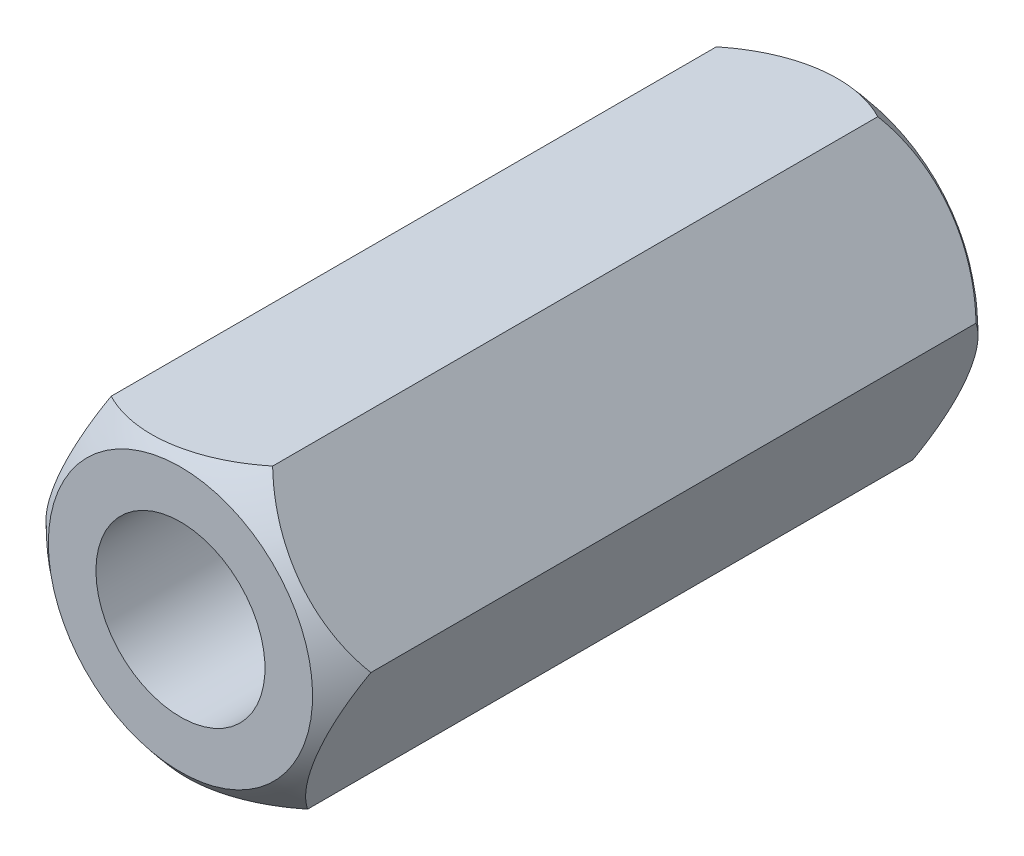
ISO-10303-21;
HEADER;
FILE_DESCRIPTION(('STEP AP214'),'2;1');
FILE_NAME('part.step','',(''),(''),'','','');
FILE_SCHEMA(('AUTOMOTIVE_DESIGN { 1 0 10303 214 1 1 1 1 }'));
ENDSEC;
DATA;
#1=APPLICATION_CONTEXT('core data for automotive mechanical design processes');
#2=APPLICATION_PROTOCOL_DEFINITION('international standard','automotive_design',2000,#1);
#3=PRODUCT_CONTEXT('',#1,'mechanical');
#4=PRODUCT('Part','Part','',(#3));
#5=PRODUCT_RELATED_PRODUCT_CATEGORY('part','',(#4));
#6=PRODUCT_DEFINITION_FORMATION('','',#4);
#7=PRODUCT_DEFINITION_CONTEXT('part definition',#1,'design');
#8=PRODUCT_DEFINITION('design','',#6,#7);
#9=PRODUCT_DEFINITION_SHAPE('','',#8);
#10=(LENGTH_UNIT() NAMED_UNIT(*) SI_UNIT(.MILLI.,.METRE.));
#11=(NAMED_UNIT(*) PLANE_ANGLE_UNIT() SI_UNIT($,.RADIAN.));
#12=(NAMED_UNIT(*) SI_UNIT($,.STERADIAN.) SOLID_ANGLE_UNIT());
#13=UNCERTAINTY_MEASURE_WITH_UNIT(LENGTH_MEASURE(1.E-05),#10,'distance_accuracy_value','');
#14=(GEOMETRIC_REPRESENTATION_CONTEXT(3) GLOBAL_UNCERTAINTY_ASSIGNED_CONTEXT((#13)) GLOBAL_UNIT_ASSIGNED_CONTEXT((#10,
#11,#12)) REPRESENTATION_CONTEXT('',''));
#15=CARTESIAN_POINT('',(0.,0.,0.));
#16=DIRECTION('',(0.,0.,1.));
#17=DIRECTION('',(1.,0.,0.));
#18=AXIS2_PLACEMENT_3D('',#15,#16,#17);
#19=CARTESIAN_POINT('',(9.73887211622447,1.21971440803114,40.));
#20=DIRECTION('',(-0.797176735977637,-0.603746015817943,0.));
#21=DIRECTION('',(0.603746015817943,-0.797176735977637,0.));
#22=AXIS2_PLACEMENT_3D('',#19,#20,#21);
#23=PLANE('',#22);
#24=DIRECTION('',(0.,0.,-1.));
#25=VECTOR('',#24,1.);
#26=CARTESIAN_POINT('',(3.81313239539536,9.04396786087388,40.));
#27=LINE('',#26,#25);
#28=CARTESIAN_POINT('',(3.81313239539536,9.04396786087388,38.2524071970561));
#29=VERTEX_POINT('',#28);
#30=CARTESIAN_POINT('',(3.81313239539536,9.04396786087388,1.74759280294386));
#31=VERTEX_POINT('',#30);
#32=EDGE_CURVE('E11',#29,#31,#27,.T.);
#33=ORIENTED_EDGE('',*,*,#32,.F.);
#34=CARTESIAN_POINT('',(6.77600225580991,5.13184113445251,29.7373608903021));
#35=DIRECTION('',(-0.797176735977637,-0.603746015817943,0.));
#36=DIRECTION('',(0.603746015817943,-0.797176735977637,0.));
#37=AXIS2_PLACEMENT_3D('',#34,#35,#36);
#38=CIRCLE('',#37,9.82798793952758);
#39=CARTESIAN_POINT('',(9.73887211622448,1.21971440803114,38.2524071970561));
#40=VERTEX_POINT('',#39);
#41=EDGE_CURVE('E89',#29,#40,#38,.F.);
#42=ORIENTED_EDGE('',*,*,#41,.T.);
#43=DIRECTION('',(0.,0.,-1.));
#44=VECTOR('',#43,1.);
#45=CARTESIAN_POINT('',(9.73887211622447,1.21971440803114,40.));
#46=LINE('',#45,#44);
#47=CARTESIAN_POINT('',(9.73887211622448,1.21971440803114,1.74759280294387));
#48=VERTEX_POINT('',#47);
#49=EDGE_CURVE('E59',#40,#48,#46,.T.);
#50=ORIENTED_EDGE('',*,*,#49,.T.);
#51=CARTESIAN_POINT('',(6.77600225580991,5.13184113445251,10.2626391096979));
#52=DIRECTION('',(-0.797176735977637,-0.603746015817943,0.));
#53=DIRECTION('',(0.603746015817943,-0.797176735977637,0.));
#54=AXIS2_PLACEMENT_3D('',#51,#52,#53);
#55=CIRCLE('',#54,9.82798793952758);
#56=EDGE_CURVE('E133',#48,#31,#55,.F.);
#57=ORIENTED_EDGE('',*,*,#56,.T.);
#58=EDGE_LOOP('',(#33,#42,#50,#57));
#59=FACE_BOUND('',#58,.T.);
#60=ADVANCED_FACE('F35',(#59),#23,.F.);
#61=CARTESIAN_POINT('',(3.81313239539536,9.04396786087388,40.));
#62=DIRECTION('',(0.124271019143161,-0.992248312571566,0.));
#63=DIRECTION('',(0.992248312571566,0.124271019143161,0.));
#64=AXIS2_PLACEMENT_3D('',#61,#62,#63);
#65=PLANE('',#64);
#66=DIRECTION('',(0.,0.,-1.));
#67=VECTOR('',#66,1.);
#68=CARTESIAN_POINT('',(-5.9257397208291,7.82425345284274,40.));
#69=LINE('',#68,#67);
#70=CARTESIAN_POINT('',(-5.9257397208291,7.82425345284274,38.2524071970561));
#71=VERTEX_POINT('',#70);
#72=CARTESIAN_POINT('',(-5.9257397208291,7.82425345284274,1.74759280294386));
#73=VERTEX_POINT('',#72);
#74=EDGE_CURVE('E43',#71,#73,#69,.T.);
#75=ORIENTED_EDGE('',*,*,#74,.F.);
#76=CARTESIAN_POINT('',(-1.05630366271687,8.43411065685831,29.7373608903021));
#77=DIRECTION('',(0.124271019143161,-0.992248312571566,0.));
#78=DIRECTION('',(0.992248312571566,0.124271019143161,0.));
#79=AXIS2_PLACEMENT_3D('',#76,#77,#78);
#80=CIRCLE('',#79,9.82798793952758);
#81=EDGE_CURVE('E96',#71,#29,#80,.F.);
#82=ORIENTED_EDGE('',*,*,#81,.T.);
#83=ORIENTED_EDGE('',*,*,#32,.T.);
#84=CARTESIAN_POINT('',(-1.05630366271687,8.43411065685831,10.2626391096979));
#85=DIRECTION('',(0.124271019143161,-0.992248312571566,0.));
#86=DIRECTION('',(0.992248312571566,0.124271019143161,0.));
#87=AXIS2_PLACEMENT_3D('',#84,#85,#86);
#88=CIRCLE('',#87,9.82798793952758);
#89=EDGE_CURVE('E130',#31,#73,#88,.F.);
#90=ORIENTED_EDGE('',*,*,#89,.T.);
#91=EDGE_LOOP('',(#75,#82,#83,#90));
#92=FACE_BOUND('',#91,.T.);
#93=ADVANCED_FACE('F156',(#92),#65,.F.);
#94=CARTESIAN_POINT('',(-5.9257397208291,7.82425345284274,40.));
#95=DIRECTION('',(0.921447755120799,-0.388502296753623,0.));
#96=DIRECTION('',(0.388502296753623,0.921447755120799,0.));
#97=AXIS2_PLACEMENT_3D('',#94,#95,#96);
#98=PLANE('',#97);
#99=DIRECTION('',(0.,0.,-1.));
#100=VECTOR('',#99,1.);
#101=CARTESIAN_POINT('',(-9.73887211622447,-1.21971440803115,40.));
#102=LINE('',#101,#100);
#103=CARTESIAN_POINT('',(-9.73887211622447,-1.21971440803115,38.2524071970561));
#104=VERTEX_POINT('',#103);
#105=CARTESIAN_POINT('',(-9.73887211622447,-1.21971440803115,1.74759280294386));
#106=VERTEX_POINT('',#105);
#107=EDGE_CURVE('E113',#104,#106,#102,.T.);
#108=ORIENTED_EDGE('',*,*,#107,.F.);
#109=CARTESIAN_POINT('',(-7.83230591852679,3.3022695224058,29.7373608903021));
#110=DIRECTION('',(0.921447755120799,-0.388502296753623,0.));
#111=DIRECTION('',(0.388502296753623,0.921447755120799,0.));
#112=AXIS2_PLACEMENT_3D('',#109,#110,#111);
#113=CIRCLE('',#112,9.82798793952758);
#114=EDGE_CURVE('E239',#104,#71,#113,.F.);
#115=ORIENTED_EDGE('',*,*,#114,.T.);
#116=ORIENTED_EDGE('',*,*,#74,.T.);
#117=CARTESIAN_POINT('',(-7.83230591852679,3.3022695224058,10.2626391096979));
#118=DIRECTION('',(0.921447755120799,-0.388502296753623,0.));
#119=DIRECTION('',(0.388502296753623,0.921447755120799,0.));
#120=AXIS2_PLACEMENT_3D('',#117,#118,#119);
#121=CIRCLE('',#120,9.82798793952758);
#122=EDGE_CURVE('E127',#73,#106,#121,.F.);
#123=ORIENTED_EDGE('',*,*,#122,.T.);
#124=EDGE_LOOP('',(#108,#115,#116,#123));
#125=FACE_BOUND('',#124,.T.);
#126=ADVANCED_FACE('F160',(#125),#98,.F.);
#127=CARTESIAN_POINT('',(-9.73887211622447,-1.21971440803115,40.));
#128=DIRECTION('',(0.797176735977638,0.603746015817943,0.));
#129=DIRECTION('',(-0.603746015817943,0.797176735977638,0.));
#130=AXIS2_PLACEMENT_3D('',#127,#128,#129);
#131=PLANE('',#130);
#132=DIRECTION('',(0.,0.,-1.));
#133=VECTOR('',#132,1.);
#134=CARTESIAN_POINT('',(-3.81313239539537,-9.04396786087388,40.));
#135=LINE('',#134,#133);
#136=CARTESIAN_POINT('',(-3.81313239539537,-9.04396786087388,38.2524071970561));
#137=VERTEX_POINT('',#136);
#138=CARTESIAN_POINT('',(-3.81313239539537,-9.04396786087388,1.74759280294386));
#139=VERTEX_POINT('',#138);
#140=EDGE_CURVE('E105',#137,#139,#135,.T.);
#141=ORIENTED_EDGE('',*,*,#140,.F.);
#142=CARTESIAN_POINT('',(-6.77600225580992,-5.13184113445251,29.7373608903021));
#143=DIRECTION('',(0.797176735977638,0.603746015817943,0.));
#144=DIRECTION('',(-0.603746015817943,0.797176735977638,0.));
#145=AXIS2_PLACEMENT_3D('',#142,#143,#144);
#146=CIRCLE('',#145,9.82798793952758);
#147=EDGE_CURVE('E235',#137,#104,#146,.F.);
#148=ORIENTED_EDGE('',*,*,#147,.T.);
#149=ORIENTED_EDGE('',*,*,#107,.T.);
#150=CARTESIAN_POINT('',(-6.77600225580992,-5.13184113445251,10.2626391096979));
#151=DIRECTION('',(0.797176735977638,0.603746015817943,0.));
#152=DIRECTION('',(-0.603746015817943,0.797176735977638,0.));
#153=AXIS2_PLACEMENT_3D('',#150,#151,#152);
#154=CIRCLE('',#153,9.82798793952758);
#155=EDGE_CURVE('E121',#106,#139,#154,.F.);
#156=ORIENTED_EDGE('',*,*,#155,.T.);
#157=EDGE_LOOP('',(#141,#148,#149,#156));
#158=FACE_BOUND('',#157,.T.);
#159=ADVANCED_FACE('F165',(#158),#131,.F.);
#160=CARTESIAN_POINT('',(-3.81313239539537,-9.04396786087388,40.));
#161=DIRECTION('',(-0.124271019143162,0.992248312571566,0.));
#162=DIRECTION('',(-0.992248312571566,-0.124271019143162,0.));
#163=AXIS2_PLACEMENT_3D('',#160,#161,#162);
#164=PLANE('',#163);
#165=DIRECTION('',(0.,0.,-1.));
#166=VECTOR('',#165,1.);
#167=CARTESIAN_POINT('',(5.92573972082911,-7.82425345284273,40.));
#168=LINE('',#167,#166);
#169=CARTESIAN_POINT('',(5.92573972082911,-7.82425345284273,38.2524071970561));
#170=VERTEX_POINT('',#169);
#171=CARTESIAN_POINT('',(5.92573972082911,-7.82425345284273,1.74759280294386));
#172=VERTEX_POINT('',#171);
#173=EDGE_CURVE('E102',#170,#172,#168,.T.);
#174=ORIENTED_EDGE('',*,*,#173,.F.);
#175=CARTESIAN_POINT('',(1.05630366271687,-8.43411065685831,29.7373608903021));
#176=DIRECTION('',(-0.124271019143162,0.992248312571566,0.));
#177=DIRECTION('',(-0.992248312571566,-0.124271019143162,0.));
#178=AXIS2_PLACEMENT_3D('',#175,#176,#177);
#179=CIRCLE('',#178,9.82798793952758);
#180=EDGE_CURVE('E51',#170,#137,#179,.F.);
#181=ORIENTED_EDGE('',*,*,#180,.T.);
#182=ORIENTED_EDGE('',*,*,#140,.T.);
#183=CARTESIAN_POINT('',(1.05630366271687,-8.43411065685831,10.2626391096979));
#184=DIRECTION('',(-0.124271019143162,0.992248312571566,0.));
#185=DIRECTION('',(-0.992248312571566,-0.124271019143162,0.));
#186=AXIS2_PLACEMENT_3D('',#183,#184,#185);
#187=CIRCLE('',#186,9.82798793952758);
#188=EDGE_CURVE('E118',#139,#172,#187,.F.);
#189=ORIENTED_EDGE('',*,*,#188,.T.);
#190=EDGE_LOOP('',(#174,#181,#182,#189));
#191=FACE_BOUND('',#190,.T.);
#192=ADVANCED_FACE('F172',(#191),#164,.F.);
#193=CARTESIAN_POINT('',(5.92573972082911,-7.82425345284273,40.));
#194=DIRECTION('',(-0.921447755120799,0.388502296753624,0.));
#195=DIRECTION('',(-0.388502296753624,-0.921447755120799,0.));
#196=AXIS2_PLACEMENT_3D('',#193,#194,#195);
#197=PLANE('',#196);
#198=ORIENTED_EDGE('',*,*,#49,.F.);
#199=CARTESIAN_POINT('',(7.83230591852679,-3.3022695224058,29.7373608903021));
#200=DIRECTION('',(-0.921447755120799,0.388502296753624,0.));
#201=DIRECTION('',(-0.388502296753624,-0.921447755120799,0.));
#202=AXIS2_PLACEMENT_3D('',#199,#200,#201);
#203=CIRCLE('',#202,9.82798793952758);
#204=EDGE_CURVE('E87',#40,#170,#203,.F.);
#205=ORIENTED_EDGE('',*,*,#204,.T.);
#206=ORIENTED_EDGE('',*,*,#173,.T.);
#207=CARTESIAN_POINT('',(7.83230591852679,-3.3022695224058,10.2626391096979));
#208=DIRECTION('',(-0.921447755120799,0.388502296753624,0.));
#209=DIRECTION('',(-0.388502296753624,-0.921447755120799,0.));
#210=AXIS2_PLACEMENT_3D('',#207,#208,#209);
#211=CIRCLE('',#210,9.82798793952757);
#212=EDGE_CURVE('E101',#172,#48,#211,.F.);
#213=ORIENTED_EDGE('',*,*,#212,.T.);
#214=EDGE_LOOP('',(#198,#205,#206,#213));
#215=FACE_BOUND('',#214,.T.);
#216=ADVANCED_FACE('F99',(#215),#197,.F.);
#217=CARTESIAN_POINT('',(9.73887211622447,1.21971440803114,40.));
#218=DIRECTION('',(0.,0.,-1.));
#219=DIRECTION('',(-1.,0.,0.));
#220=AXIS2_PLACEMENT_3D('',#217,#218,#219);
#221=PLANE('',#220);
#222=CARTESIAN_POINT('',(0.,0.,40.));
#223=DIRECTION('',(0.,0.,-1.));
#224=DIRECTION('',(-1.,0.,0.));
#225=AXIS2_PLACEMENT_3D('',#222,#223,#224);
#226=CIRCLE('',#225,7.96979205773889);
#227=CARTESIAN_POINT('',(-7.96979205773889,0.,40.));
#228=VERTEX_POINT('',#227);
#229=EDGE_CURVE('E38',#228,#228,#226,.F.);
#230=ORIENTED_EDGE('',*,*,#229,.T.);
#231=EDGE_LOOP('',(#230));
#232=FACE_BOUND('',#231,.T.);
#233=CARTESIAN_POINT('',(0.,0.,40.));
#234=DIRECTION('',(0.,0.,-1.));
#235=DIRECTION('',(-1.,0.,0.));
#236=AXIS2_PLACEMENT_3D('',#233,#234,#235);
#237=CIRCLE('',#236,5.09999999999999);
#238=CARTESIAN_POINT('',(-5.09999999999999,0.,40.));
#239=VERTEX_POINT('',#238);
#240=EDGE_CURVE('E108',#239,#239,#237,.T.);
#241=ORIENTED_EDGE('',*,*,#240,.T.);
#242=EDGE_LOOP('',(#241));
#243=FACE_BOUND('',#242,.T.);
#244=ADVANCED_FACE('F137',(#232,#243),#221,.F.);
#245=CARTESIAN_POINT('',(9.73887211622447,1.21971440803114,0.));
#246=DIRECTION('',(0.,0.,-1.));
#247=DIRECTION('',(-1.,0.,0.));
#248=AXIS2_PLACEMENT_3D('',#245,#246,#247);
#249=PLANE('',#248);
#250=CARTESIAN_POINT('',(0.,0.,0.));
#251=DIRECTION('',(0.,0.,-1.));
#252=DIRECTION('',(-1.,0.,0.));
#253=AXIS2_PLACEMENT_3D('',#250,#251,#252);
#254=CIRCLE('',#253,7.96979205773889);
#255=CARTESIAN_POINT('',(-7.96979205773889,0.,0.));
#256=VERTEX_POINT('',#255);
#257=EDGE_CURVE('E95',#256,#256,#254,.F.);
#258=ORIENTED_EDGE('',*,*,#257,.F.);
#259=EDGE_LOOP('',(#258));
#260=FACE_BOUND('',#259,.T.);
#261=CARTESIAN_POINT('',(0.,0.,0.));
#262=DIRECTION('',(0.,0.,-1.));
#263=DIRECTION('',(-1.,0.,0.));
#264=AXIS2_PLACEMENT_3D('',#261,#262,#263);
#265=CIRCLE('',#264,5.1);
#266=CARTESIAN_POINT('',(-5.1,0.,0.));
#267=VERTEX_POINT('',#266);
#268=EDGE_CURVE('E103',#267,#267,#265,.T.);
#269=ORIENTED_EDGE('',*,*,#268,.F.);
#270=EDGE_LOOP('',(#269));
#271=FACE_BOUND('',#270,.T.);
#272=ADVANCED_FACE('F143',(#260,#271),#249,.T.);
#273=CARTESIAN_POINT('',(0.,0.,0.));
#274=DIRECTION('',(0.,0.,-1.));
#275=DIRECTION('',(-1.,0.,0.));
#276=AXIS2_PLACEMENT_3D('',#273,#274,#275);
#277=CYLINDRICAL_SURFACE('',#276,5.09999999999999);
#278=ORIENTED_EDGE('',*,*,#240,.F.);
#279=EDGE_LOOP('',(#278));
#280=FACE_BOUND('',#279,.T.);
#281=ORIENTED_EDGE('',*,*,#268,.T.);
#282=EDGE_LOOP('',(#281));
#283=FACE_BOUND('',#282,.T.);
#284=ADVANCED_FACE('F139',(#280,#283),#277,.F.);
#285=CARTESIAN_POINT('',(0.,0.,10.2626391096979));
#286=DIRECTION('',(0.,0.,1.));
#287=DIRECTION('',(1.,0.,0.));
#288=AXIS2_PLACEMENT_3D('',#285,#286,#287);
#289=SPHERICAL_SURFACE('',#288,12.9938195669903);
#290=ORIENTED_EDGE('',*,*,#257,.T.);
#291=EDGE_LOOP('',(#290));
#292=FACE_BOUND('',#291,.T.);
#293=ORIENTED_EDGE('',*,*,#212,.F.);
#294=ORIENTED_EDGE('',*,*,#188,.F.);
#295=ORIENTED_EDGE('',*,*,#155,.F.);
#296=ORIENTED_EDGE('',*,*,#122,.F.);
#297=ORIENTED_EDGE('',*,*,#89,.F.);
#298=ORIENTED_EDGE('',*,*,#56,.F.);
#299=EDGE_LOOP('',(#293,#294,#295,#296,#297,#298));
#300=FACE_BOUND('',#299,.T.);
#301=ADVANCED_FACE('F142',(#292,#300),#289,.T.);
#302=CARTESIAN_POINT('',(0.,0.,29.7373608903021));
#303=DIRECTION('',(0.,0.,1.));
#304=DIRECTION('',(1.,0.,0.));
#305=AXIS2_PLACEMENT_3D('',#302,#303,#304);
#306=SPHERICAL_SURFACE('',#305,12.9938195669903);
#307=ORIENTED_EDGE('',*,*,#229,.F.);
#308=EDGE_LOOP('',(#307));
#309=FACE_BOUND('',#308,.T.);
#310=ORIENTED_EDGE('',*,*,#81,.F.);
#311=ORIENTED_EDGE('',*,*,#114,.F.);
#312=ORIENTED_EDGE('',*,*,#147,.F.);
#313=ORIENTED_EDGE('',*,*,#180,.F.);
#314=ORIENTED_EDGE('',*,*,#204,.F.);
#315=ORIENTED_EDGE('',*,*,#41,.F.);
#316=EDGE_LOOP('',(#310,#311,#312,#313,#314,#315));
#317=FACE_BOUND('',#316,.T.);
#318=ADVANCED_FACE('F88',(#309,#317),#306,.T.);
#319=CLOSED_SHELL('',(#60,#93,#126,#159,#192,#216,#244,#272,#284,#301,#318));
#320=MANIFOLD_SOLID_BREP('B2',#319);
#321=ADVANCED_BREP_SHAPE_REPRESENTATION('',(#18,#320),#14);
#322=SHAPE_DEFINITION_REPRESENTATION(#9,#321);
ENDSEC;
END-ISO-10303-21;
